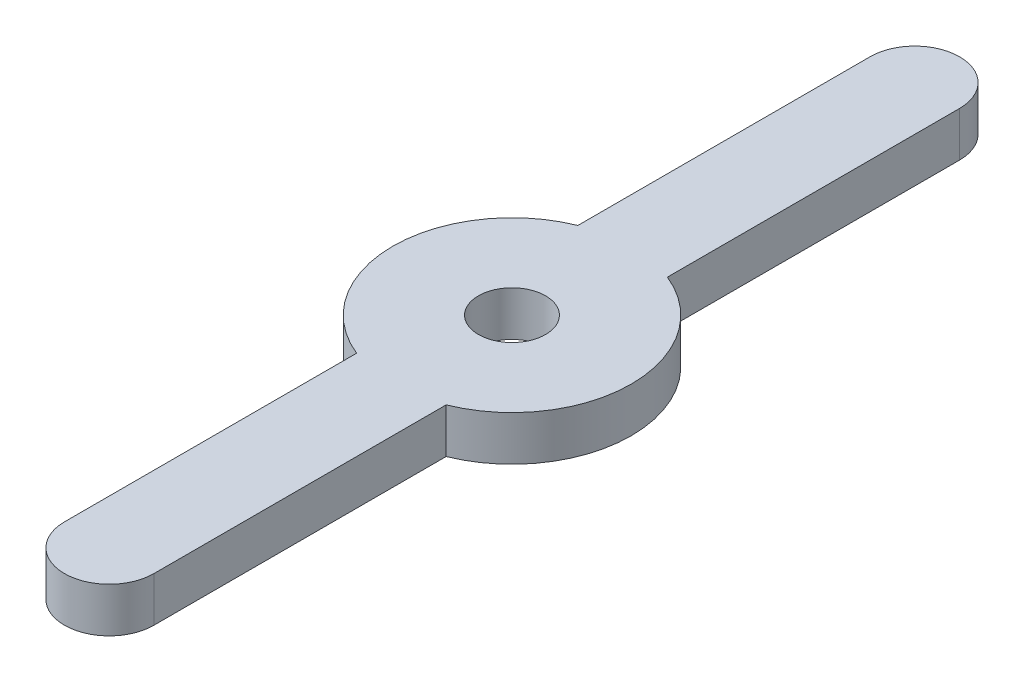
from build123d import *

# Parameters (mm, degrees)
SKETCH1_R      = 2.25
EXTRUDE1_DEPTH = 3


with BuildPart() as part:
    # Sketch1 → Extrude1 (new body)
    with BuildSketch(Plane(origin=(0, 0, 0), x_dir=(1, 0, 0), z_dir=(0, 1, 0))):
        with BuildLine():
            Line((-3, 54), (-3, 34.416198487))
            ThreePointArc((-3, 34.416198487), (-8, 27), (-3, 19.583801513))
            Line((-3, 19.583801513), (-3, 0))
            ThreePointArc((-3, 0), (0, -3), (3, 0))
            Line((3, 0), (3, 19.583801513))
            ThreePointArc((3, 19.583801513), (8, 27), (3, 34.416198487))
            Line((3, 34.416198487), (3, 54))
            ThreePointArc((3, 54), (0, 57), (-3, 54))
        make_face()
        with Locations(Location((0, 27, 0), (0, 0, 270))):
            Circle(SKETCH1_R, mode=Mode.SUBTRACT)
    extrude(amount=EXTRUDE1_DEPTH)


solid = part.part
